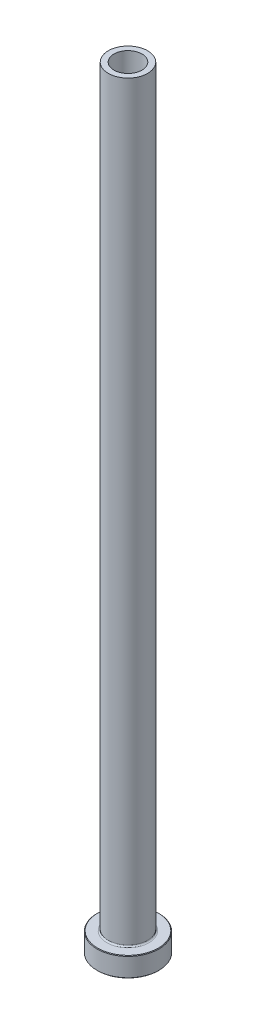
from build123d import *

# Parameters (mm, degrees)
FILLET1_R     = 0.5
CHAMFER1_SIZE = 0.2
CHAMFER3_SIZE = 0.5


with BuildPart() as part:
    # Sketch1 → Revolve1 (revolve)
    with BuildSketch(Plane.XY, mode=Mode.PRIVATE) as revolve1_sk:
        Polygon((-5, 275), (-7, 275), (-7, 7), (-11, 7), (-11, 0), (-5.25, 0), (-5.25, 218), (-5, 230), align=None)
    revolve(revolve1_sk.sketch.rotate(Axis((0, 92.187680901, 0), (0, -1, 0)), 270), axis=Axis((0, 92.187680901, 0), (0, -1, 0)))

    # Fillet1
    fillet1_edges = [part.edges().sort_by_distance(p)[0] for p in [
        (0, 7, -7),
    ]]
    fillet(fillet1_edges, radius=FILLET1_R)

    # Chamfer1
    chamfer1_edges = [part.edges().sort_by_distance(p)[0] for p in [
        (0, 0, -11),
        (0, 7, -11),
    ]]
    chamfer(chamfer1_edges, length=CHAMFER1_SIZE)

    # Chamfer3
    chamfer3_edges = [part.edges().sort_by_distance(p)[0] for p in [
        (0, 0, -5.25),
    ]]
    chamfer(chamfer3_edges, length=CHAMFER3_SIZE)


solid = part.part
